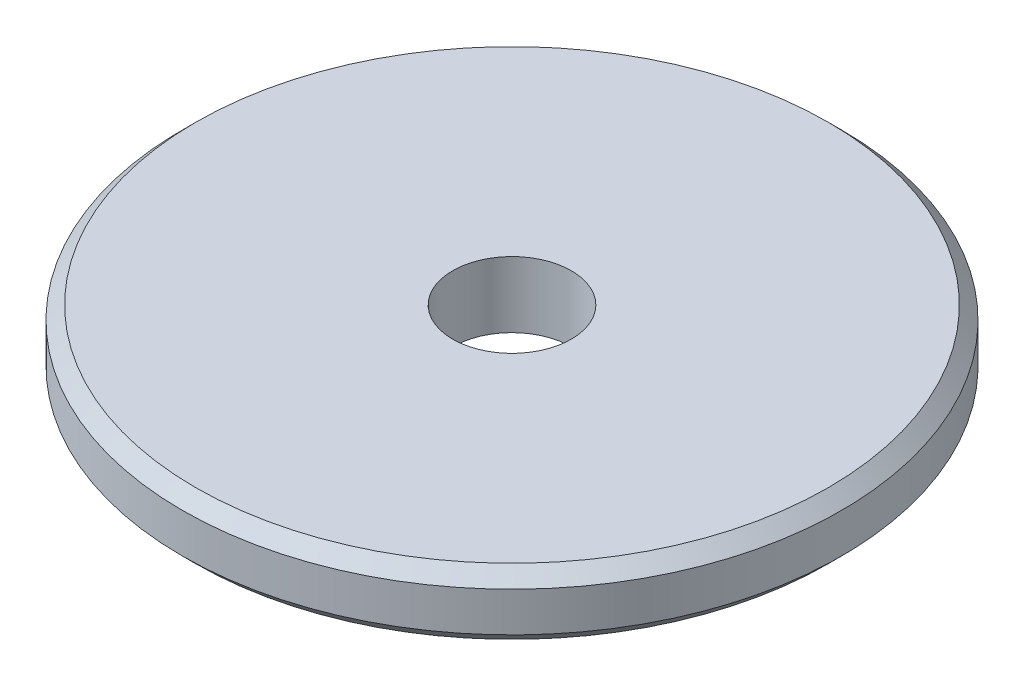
ISO-10303-21;
HEADER;
FILE_DESCRIPTION(('STEP AP214'),'2;1');
FILE_NAME('part.step','',(''),(''),'','','');
FILE_SCHEMA(('AUTOMOTIVE_DESIGN { 1 0 10303 214 1 1 1 1 }'));
ENDSEC;
DATA;
#1=APPLICATION_CONTEXT('core data for automotive mechanical design processes');
#2=APPLICATION_PROTOCOL_DEFINITION('international standard','automotive_design',2000,#1);
#3=PRODUCT_CONTEXT('',#1,'mechanical');
#4=PRODUCT('Part','Part','',(#3));
#5=PRODUCT_RELATED_PRODUCT_CATEGORY('part','',(#4));
#6=PRODUCT_DEFINITION_FORMATION('','',#4);
#7=PRODUCT_DEFINITION_CONTEXT('part definition',#1,'design');
#8=PRODUCT_DEFINITION('design','',#6,#7);
#9=PRODUCT_DEFINITION_SHAPE('','',#8);
#10=(LENGTH_UNIT() NAMED_UNIT(*) SI_UNIT(.MILLI.,.METRE.));
#11=(NAMED_UNIT(*) PLANE_ANGLE_UNIT() SI_UNIT($,.RADIAN.));
#12=(NAMED_UNIT(*) SI_UNIT($,.STERADIAN.) SOLID_ANGLE_UNIT());
#13=UNCERTAINTY_MEASURE_WITH_UNIT(LENGTH_MEASURE(1.E-05),#10,'distance_accuracy_value','');
#14=(GEOMETRIC_REPRESENTATION_CONTEXT(3) GLOBAL_UNCERTAINTY_ASSIGNED_CONTEXT((#13)) GLOBAL_UNIT_ASSIGNED_CONTEXT((#10,
#11,#12)) REPRESENTATION_CONTEXT('',''));
#15=CARTESIAN_POINT('',(0.,0.,0.));
#16=DIRECTION('',(0.,0.,1.));
#17=DIRECTION('',(1.,0.,0.));
#18=AXIS2_PLACEMENT_3D('',#15,#16,#17);
#19=CARTESIAN_POINT('',(0.,5.,0.));
#20=DIRECTION('',(0.,1.,0.));
#21=DIRECTION('',(0.,0.,1.));
#22=AXIS2_PLACEMENT_3D('',#19,#20,#21);
#23=PLANE('',#22);
#24=CARTESIAN_POINT('',(0.,5.,0.));
#25=DIRECTION('',(0.,1.,0.));
#26=DIRECTION('',(0.,0.,1.));
#27=AXIS2_PLACEMENT_3D('',#24,#25,#26);
#28=CIRCLE('',#27,24.);
#29=CARTESIAN_POINT('',(0.,5.,24.));
#30=VERTEX_POINT('',#29);
#31=EDGE_CURVE('E10',#30,#30,#28,.T.);
#32=ORIENTED_EDGE('',*,*,#31,.T.);
#33=EDGE_LOOP('',(#32));
#34=FACE_BOUND('',#33,.T.);
#35=CARTESIAN_POINT('',(0.,5.,0.));
#36=DIRECTION('',(0.,1.,0.));
#37=DIRECTION('',(0.,0.,1.));
#38=AXIS2_PLACEMENT_3D('',#35,#36,#37);
#39=CIRCLE('',#38,4.5);
#40=CARTESIAN_POINT('',(0.,5.,4.5));
#41=VERTEX_POINT('',#40);
#42=EDGE_CURVE('E49',#41,#41,#39,.T.);
#43=ORIENTED_EDGE('',*,*,#42,.F.);
#44=EDGE_LOOP('',(#43));
#45=FACE_BOUND('',#44,.T.);
#46=ADVANCED_FACE('F29',(#34,#45),#23,.T.);
#47=CARTESIAN_POINT('',(0.,0.,0.));
#48=DIRECTION('',(0.,1.,0.));
#49=DIRECTION('',(0.,0.,1.));
#50=AXIS2_PLACEMENT_3D('',#47,#48,#49);
#51=PLANE('',#50);
#52=CARTESIAN_POINT('',(0.,0.,0.));
#53=DIRECTION('',(0.,1.,0.));
#54=DIRECTION('',(0.,0.,1.));
#55=AXIS2_PLACEMENT_3D('',#52,#53,#54);
#56=CIRCLE('',#55,24.);
#57=CARTESIAN_POINT('',(0.,0.,24.));
#58=VERTEX_POINT('',#57);
#59=EDGE_CURVE('E36',#58,#58,#56,.F.);
#60=ORIENTED_EDGE('',*,*,#59,.T.);
#61=EDGE_LOOP('',(#60));
#62=FACE_BOUND('',#61,.T.);
#63=CARTESIAN_POINT('',(0.,0.,0.));
#64=DIRECTION('',(0.,1.,0.));
#65=DIRECTION('',(0.,0.,1.));
#66=AXIS2_PLACEMENT_3D('',#63,#64,#65);
#67=CIRCLE('',#66,4.5);
#68=CARTESIAN_POINT('',(0.,0.,4.5));
#69=VERTEX_POINT('',#68);
#70=EDGE_CURVE('E50',#69,#69,#67,.T.);
#71=ORIENTED_EDGE('',*,*,#70,.T.);
#72=EDGE_LOOP('',(#71));
#73=FACE_BOUND('',#72,.T.);
#74=ADVANCED_FACE('F60',(#62,#73),#51,.F.);
#75=CARTESIAN_POINT('',(0.,5.,0.));
#76=DIRECTION('',(0.,-1.,0.));
#77=DIRECTION('',(0.,0.,-1.));
#78=AXIS2_PLACEMENT_3D('',#75,#76,#77);
#79=CYLINDRICAL_SURFACE('',#78,25.);
#80=CARTESIAN_POINT('',(0.,1.,0.));
#81=DIRECTION('',(0.,1.,0.));
#82=DIRECTION('',(0.,0.,1.));
#83=AXIS2_PLACEMENT_3D('',#80,#81,#82);
#84=CIRCLE('',#83,25.);
#85=CARTESIAN_POINT('',(0.,1.,25.));
#86=VERTEX_POINT('',#85);
#87=EDGE_CURVE('E40',#86,#86,#84,.T.);
#88=ORIENTED_EDGE('',*,*,#87,.T.);
#89=EDGE_LOOP('',(#88));
#90=FACE_BOUND('',#89,.T.);
#91=CARTESIAN_POINT('',(0.,4.00000000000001,0.));
#92=DIRECTION('',(0.,1.,0.));
#93=DIRECTION('',(0.,0.,1.));
#94=AXIS2_PLACEMENT_3D('',#91,#92,#93);
#95=CIRCLE('',#94,25.);
#96=CARTESIAN_POINT('',(0.,4.00000000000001,25.));
#97=VERTEX_POINT('',#96);
#98=EDGE_CURVE('E44',#97,#97,#95,.F.);
#99=ORIENTED_EDGE('',*,*,#98,.T.);
#100=EDGE_LOOP('',(#99));
#101=FACE_BOUND('',#100,.T.);
#102=ADVANCED_FACE('F65',(#90,#101),#79,.T.);
#103=CARTESIAN_POINT('',(0.,5.,0.));
#104=DIRECTION('',(0.,-1.,0.));
#105=DIRECTION('',(0.,0.,-1.));
#106=AXIS2_PLACEMENT_3D('',#103,#104,#105);
#107=CYLINDRICAL_SURFACE('',#106,4.5);
#108=ORIENTED_EDGE('',*,*,#42,.T.);
#109=EDGE_LOOP('',(#108));
#110=FACE_BOUND('',#109,.T.);
#111=ORIENTED_EDGE('',*,*,#70,.F.);
#112=EDGE_LOOP('',(#111));
#113=FACE_BOUND('',#112,.T.);
#114=ADVANCED_FACE('F56',(#110,#113),#107,.F.);
#115=CARTESIAN_POINT('',(0.,1.,0.));
#116=DIRECTION('',(0.,1.,0.));
#117=DIRECTION('',(0.,0.,1.));
#118=AXIS2_PLACEMENT_3D('',#115,#116,#117);
#119=CONICAL_SURFACE('',#118,25.,0.78539816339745);
#120=ORIENTED_EDGE('',*,*,#59,.F.);
#121=EDGE_LOOP('',(#120));
#122=FACE_BOUND('',#121,.T.);
#123=ORIENTED_EDGE('',*,*,#87,.F.);
#124=EDGE_LOOP('',(#123));
#125=FACE_BOUND('',#124,.T.);
#126=ADVANCED_FACE('F71',(#122,#125),#119,.T.);
#127=CARTESIAN_POINT('',(0.,5.,0.));
#128=DIRECTION('',(0.,-1.,0.));
#129=DIRECTION('',(0.,0.,-1.));
#130=AXIS2_PLACEMENT_3D('',#127,#128,#129);
#131=CONICAL_SURFACE('',#130,24.,0.785398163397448);
#132=ORIENTED_EDGE('',*,*,#98,.F.);
#133=EDGE_LOOP('',(#132));
#134=FACE_BOUND('',#133,.T.);
#135=ORIENTED_EDGE('',*,*,#31,.F.);
#136=EDGE_LOOP('',(#135));
#137=FACE_BOUND('',#136,.T.);
#138=ADVANCED_FACE('F31',(#134,#137),#131,.T.);
#139=CLOSED_SHELL('',(#46,#74,#102,#114,#126,#138));
#140=MANIFOLD_SOLID_BREP('B2',#139);
#141=ADVANCED_BREP_SHAPE_REPRESENTATION('',(#18,#140),#14);
#142=SHAPE_DEFINITION_REPRESENTATION(#9,#141);
ENDSEC;
END-ISO-10303-21;
